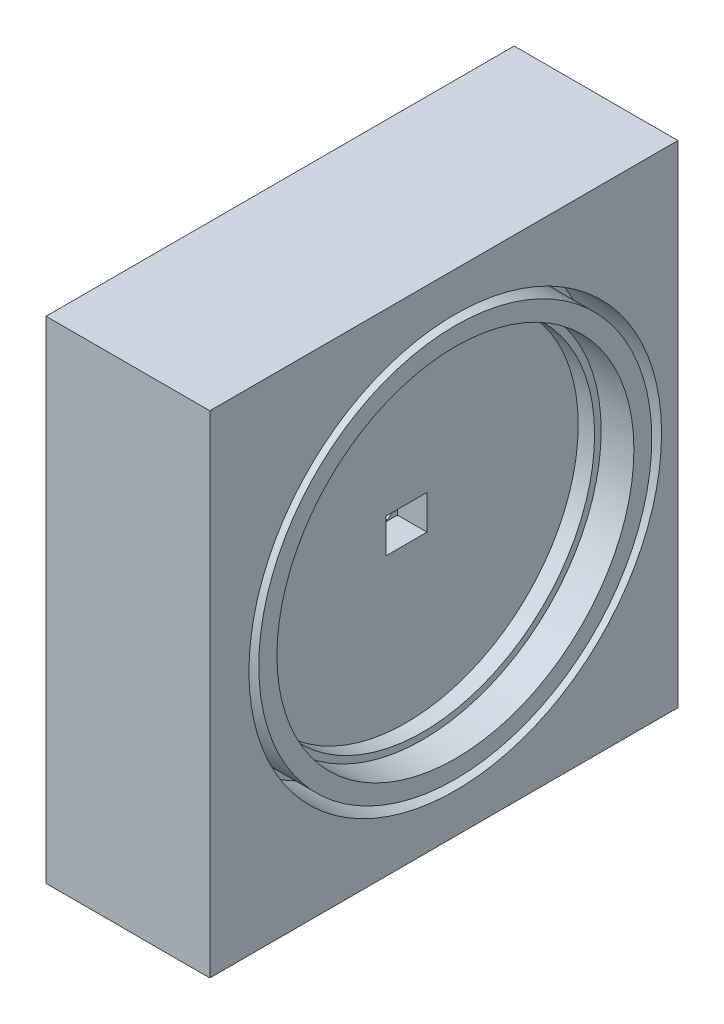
ISO-10303-21;
HEADER;
FILE_DESCRIPTION(('STEP AP214'),'2;1');
FILE_NAME('part.step','',(''),(''),'','','');
FILE_SCHEMA(('AUTOMOTIVE_DESIGN { 1 0 10303 214 1 1 1 1 }'));
ENDSEC;
DATA;
#1=APPLICATION_CONTEXT('core data for automotive mechanical design processes');
#2=APPLICATION_PROTOCOL_DEFINITION('international standard','automotive_design',2000,#1);
#3=PRODUCT_CONTEXT('',#1,'mechanical');
#4=PRODUCT('Part','Part','',(#3));
#5=PRODUCT_RELATED_PRODUCT_CATEGORY('part','',(#4));
#6=PRODUCT_DEFINITION_FORMATION('','',#4);
#7=PRODUCT_DEFINITION_CONTEXT('part definition',#1,'design');
#8=PRODUCT_DEFINITION('design','',#6,#7);
#9=PRODUCT_DEFINITION_SHAPE('','',#8);
#10=(LENGTH_UNIT() NAMED_UNIT(*) SI_UNIT(.MILLI.,.METRE.));
#11=(NAMED_UNIT(*) PLANE_ANGLE_UNIT() SI_UNIT($,.RADIAN.));
#12=(NAMED_UNIT(*) SI_UNIT($,.STERADIAN.) SOLID_ANGLE_UNIT());
#13=UNCERTAINTY_MEASURE_WITH_UNIT(LENGTH_MEASURE(1.E-05),#10,'distance_accuracy_value','');
#14=(GEOMETRIC_REPRESENTATION_CONTEXT(3) GLOBAL_UNCERTAINTY_ASSIGNED_CONTEXT((#13)) GLOBAL_UNIT_ASSIGNED_CONTEXT((#10,
#11,#12)) REPRESENTATION_CONTEXT('',''));
#15=CARTESIAN_POINT('',(0.,0.,0.));
#16=DIRECTION('',(0.,0.,1.));
#17=DIRECTION('',(1.,0.,0.));
#18=AXIS2_PLACEMENT_3D('',#15,#16,#17);
#19=CARTESIAN_POINT('',(-20.,250.,0.));
#20=DIRECTION('',(1.,0.,0.));
#21=DIRECTION('',(0.,0.,-1.));
#22=AXIS2_PLACEMENT_3D('',#19,#20,#21);
#23=PLANE('',#22);
#24=CARTESIAN_POINT('',(-20.,175.071160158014,-74.9504573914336));
#25=DIRECTION('',(1.,0.,0.));
#26=DIRECTION('',(0.,0.,-1.));
#27=AXIS2_PLACEMENT_3D('',#24,#25,#26);
#28=CIRCLE('',#27,3.50000000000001);
#29=CARTESIAN_POINT('',(-20.,175.071160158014,-78.4504573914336));
#30=VERTEX_POINT('',#29);
#31=EDGE_CURVE('E356',#30,#30,#28,.T.);
#32=ORIENTED_EDGE('',*,*,#31,.T.);
#33=EDGE_LOOP('',(#32));
#34=FACE_BOUND('',#33,.T.);
#35=DIRECTION('',(0.,0.,-1.));
#36=VECTOR('',#35,1.);
#37=CARTESIAN_POINT('',(-20.,100.,0.));
#38=LINE('',#37,#36);
#39=CARTESIAN_POINT('',(-20.,100.,0.));
#40=VERTEX_POINT('',#39);
#41=CARTESIAN_POINT('',(-20.,100.,-142.943134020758));
#42=VERTEX_POINT('',#41);
#43=EDGE_CURVE('E333',#40,#42,#38,.T.);
#44=ORIENTED_EDGE('',*,*,#43,.F.);
#45=DIRECTION('',(0.,-1.,0.));
#46=VECTOR('',#45,1.);
#47=CARTESIAN_POINT('',(-20.,250.,0.));
#48=LINE('',#47,#46);
#49=CARTESIAN_POINT('',(-20.,250.,0.));
#50=VERTEX_POINT('',#49);
#51=EDGE_CURVE('E609',#50,#40,#48,.T.);
#52=ORIENTED_EDGE('',*,*,#51,.F.);
#53=DIRECTION('',(0.,0.,1.));
#54=VECTOR('',#53,1.);
#55=CARTESIAN_POINT('',(-20.,250.,0.));
#56=LINE('',#55,#54);
#57=CARTESIAN_POINT('',(-20.,250.,-142.943134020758));
#58=VERTEX_POINT('',#57);
#59=EDGE_CURVE('E606',#58,#50,#56,.T.);
#60=ORIENTED_EDGE('',*,*,#59,.F.);
#61=DIRECTION('',(0.,-1.,0.));
#62=VECTOR('',#61,1.);
#63=CARTESIAN_POINT('',(-20.,250.,-142.943134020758));
#64=LINE('',#63,#62);
#65=EDGE_CURVE('E364',#58,#42,#64,.T.);
#66=ORIENTED_EDGE('',*,*,#65,.T.);
#67=EDGE_LOOP('',(#44,#52,#60,#66));
#68=FACE_BOUND('',#67,.T.);
#69=ADVANCED_FACE('F52',(#34,#68),#23,.F.);
#70=CARTESIAN_POINT('',(30.,250.,-150.));
#71=DIRECTION('',(-1.,0.,0.));
#72=DIRECTION('',(0.,0.,1.));
#73=AXIS2_PLACEMENT_3D('',#70,#71,#72);
#74=PLANE('',#73);
#75=CARTESIAN_POINT('',(30.,175.071160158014,-74.9504573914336));
#76=DIRECTION('',(1.,0.,0.));
#77=DIRECTION('',(0.,0.,-1.));
#78=AXIS2_PLACEMENT_3D('',#75,#76,#77);
#79=CIRCLE('',#78,63.);
#80=CARTESIAN_POINT('',(30.,175.071160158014,-137.950457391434));
#81=VERTEX_POINT('',#80);
#82=EDGE_CURVE('E341',#81,#81,#79,.T.);
#83=ORIENTED_EDGE('',*,*,#82,.F.);
#84=EDGE_LOOP('',(#83));
#85=FACE_BOUND('',#84,.T.);
#86=DIRECTION('',(0.,0.,1.));
#87=VECTOR('',#86,1.);
#88=CARTESIAN_POINT('',(30.,100.,-150.));
#89=LINE('',#88,#87);
#90=CARTESIAN_POINT('',(30.,100.,-142.943134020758));
#91=VERTEX_POINT('',#90);
#92=CARTESIAN_POINT('',(30.,100.,0.));
#93=VERTEX_POINT('',#92);
#94=EDGE_CURVE('E330',#91,#93,#89,.T.);
#95=ORIENTED_EDGE('',*,*,#94,.F.);
#96=DIRECTION('',(0.,-1.,0.));
#97=VECTOR('',#96,1.);
#98=CARTESIAN_POINT('',(30.,250.,-142.943134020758));
#99=LINE('',#98,#97);
#100=CARTESIAN_POINT('',(30.,250.,-142.943134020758));
#101=VERTEX_POINT('',#100);
#102=EDGE_CURVE('E357',#101,#91,#99,.T.);
#103=ORIENTED_EDGE('',*,*,#102,.F.);
#104=DIRECTION('',(0.,0.,-1.));
#105=VECTOR('',#104,1.);
#106=CARTESIAN_POINT('',(30.,250.,-150.));
#107=LINE('',#106,#105);
#108=CARTESIAN_POINT('',(30.,250.,0.));
#109=VERTEX_POINT('',#108);
#110=EDGE_CURVE('E602',#109,#101,#107,.T.);
#111=ORIENTED_EDGE('',*,*,#110,.F.);
#112=DIRECTION('',(0.,-1.,0.));
#113=VECTOR('',#112,1.);
#114=CARTESIAN_POINT('',(30.,250.,0.));
#115=LINE('',#114,#113);
#116=EDGE_CURVE('E613',#109,#93,#115,.T.);
#117=ORIENTED_EDGE('',*,*,#116,.T.);
#118=EDGE_LOOP('',(#95,#103,#111,#117));
#119=FACE_BOUND('',#118,.T.);
#120=ADVANCED_FACE('F482',(#85,#119),#74,.F.);
#121=CARTESIAN_POINT('',(-20.,250.,0.));
#122=DIRECTION('',(0.,0.,-1.));
#123=DIRECTION('',(-1.,0.,0.));
#124=AXIS2_PLACEMENT_3D('',#121,#122,#123);
#125=PLANE('',#124);
#126=DIRECTION('',(-1.,0.,0.));
#127=VECTOR('',#126,1.);
#128=CARTESIAN_POINT('',(80.,100.,0.));
#129=LINE('',#128,#127);
#130=EDGE_CURVE('E318',#93,#40,#129,.T.);
#131=ORIENTED_EDGE('',*,*,#130,.F.);
#132=ORIENTED_EDGE('',*,*,#116,.F.);
#133=DIRECTION('',(1.,0.,0.));
#134=VECTOR('',#133,1.);
#135=CARTESIAN_POINT('',(-20.,250.,0.));
#136=LINE('',#135,#134);
#137=EDGE_CURVE('E598',#50,#109,#136,.T.);
#138=ORIENTED_EDGE('',*,*,#137,.F.);
#139=ORIENTED_EDGE('',*,*,#51,.T.);
#140=EDGE_LOOP('',(#131,#132,#138,#139));
#141=FACE_BOUND('',#140,.T.);
#142=ADVANCED_FACE('F54',(#141),#125,.F.);
#143=CARTESIAN_POINT('',(-91.,250.,-142.943134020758));
#144=DIRECTION('',(0.,0.,1.));
#145=DIRECTION('',(0.,-1.,0.));
#146=AXIS2_PLACEMENT_3D('',#143,#144,#145);
#147=PLANE('',#146);
#148=DIRECTION('',(1.,0.,0.));
#149=VECTOR('',#148,1.);
#150=CARTESIAN_POINT('',(17.5,187.5,-142.943134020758));
#151=LINE('',#150,#149);
#152=CARTESIAN_POINT('',(-7.50000000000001,187.5,-142.943134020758));
#153=VERTEX_POINT('',#152);
#154=CARTESIAN_POINT('',(17.5,187.5,-142.943134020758));
#155=VERTEX_POINT('',#154);
#156=EDGE_CURVE('E250',#153,#155,#151,.T.);
#157=ORIENTED_EDGE('',*,*,#156,.F.);
#158=DIRECTION('',(0.,1.,0.));
#159=VECTOR('',#158,1.);
#160=CARTESIAN_POINT('',(-7.50000000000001,162.5,-142.943134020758));
#161=LINE('',#160,#159);
#162=CARTESIAN_POINT('',(-7.50000000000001,162.5,-142.943134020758));
#163=VERTEX_POINT('',#162);
#164=EDGE_CURVE('E68',#163,#153,#161,.T.);
#165=ORIENTED_EDGE('',*,*,#164,.F.);
#166=DIRECTION('',(-1.,0.,0.));
#167=VECTOR('',#166,1.);
#168=CARTESIAN_POINT('',(17.5,162.5,-142.943134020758));
#169=LINE('',#168,#167);
#170=CARTESIAN_POINT('',(17.5,162.5,-142.943134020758));
#171=VERTEX_POINT('',#170);
#172=EDGE_CURVE('E237',#171,#163,#169,.T.);
#173=ORIENTED_EDGE('',*,*,#172,.F.);
#174=DIRECTION('',(0.,-1.,0.));
#175=VECTOR('',#174,1.);
#176=CARTESIAN_POINT('',(17.5,162.5,-142.943134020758));
#177=LINE('',#176,#175);
#178=EDGE_CURVE('E241',#155,#171,#177,.T.);
#179=ORIENTED_EDGE('',*,*,#178,.F.);
#180=EDGE_LOOP('',(#157,#165,#173,#179));
#181=FACE_BOUND('',#180,.T.);
#182=DIRECTION('',(1.,0.,0.));
#183=VECTOR('',#182,1.);
#184=CARTESIAN_POINT('',(-91.,100.,-142.943134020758));
#185=LINE('',#184,#183);
#186=EDGE_CURVE('E617',#42,#91,#185,.T.);
#187=ORIENTED_EDGE('',*,*,#186,.F.);
#188=ORIENTED_EDGE('',*,*,#65,.F.);
#189=DIRECTION('',(1.,0.,0.));
#190=VECTOR('',#189,1.);
#191=CARTESIAN_POINT('',(-91.,250.,-142.943134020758));
#192=LINE('',#191,#190);
#193=EDGE_CURVE('E361',#58,#101,#192,.T.);
#194=ORIENTED_EDGE('',*,*,#193,.T.);
#195=ORIENTED_EDGE('',*,*,#102,.T.);
#196=EDGE_LOOP('',(#187,#188,#194,#195));
#197=FACE_BOUND('',#196,.T.);
#198=ADVANCED_FACE('F489',(#181,#197),#147,.F.);
#199=CARTESIAN_POINT('',(30.,175.,-75.));
#200=DIRECTION('',(1.,0.,0.));
#201=DIRECTION('',(0.,0.,-1.));
#202=AXIS2_PLACEMENT_3D('',#199,#200,#201);
#203=CIRCLE('',#202,54.5);
#204=CARTESIAN_POINT('',(30.,175.,-129.5));
#205=VERTEX_POINT('',#204);
#206=EDGE_CURVE('E368',#205,#205,#203,.T.);
#207=ORIENTED_EDGE('',*,*,#206,.F.);
#208=EDGE_LOOP('',(#207));
#209=FACE_BOUND('',#208,.T.);
#210=CARTESIAN_POINT('',(30.,175.071160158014,-74.9504573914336));
#211=DIRECTION('',(1.,0.,0.));
#212=DIRECTION('',(0.,0.,-1.));
#213=AXIS2_PLACEMENT_3D('',#210,#211,#212);
#214=CIRCLE('',#213,60.);
#215=CARTESIAN_POINT('',(30.,175.071160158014,-134.950457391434));
#216=VERTEX_POINT('',#215);
#217=EDGE_CURVE('E336',#216,#216,#214,.T.);
#218=ORIENTED_EDGE('',*,*,#217,.T.);
#219=EDGE_LOOP('',(#218));
#220=FACE_BOUND('',#219,.T.);
#221=ADVANCED_FACE('F473',(#209,#220),#74,.F.);
#222=CARTESIAN_POINT('',(15.,175.,-75.));
#223=DIRECTION('',(1.,0.,0.));
#224=DIRECTION('',(0.,0.,-1.));
#225=AXIS2_PLACEMENT_3D('',#222,#223,#224);
#226=CYLINDRICAL_SURFACE('',#225,52.5);
#227=CARTESIAN_POINT('',(15.,175.,-75.));
#228=DIRECTION('',(1.,0.,0.));
#229=DIRECTION('',(0.,0.,-1.));
#230=AXIS2_PLACEMENT_3D('',#227,#228,#229);
#231=CIRCLE('',#230,52.5);
#232=CARTESIAN_POINT('',(15.,175.,-127.5));
#233=VERTEX_POINT('',#232);
#234=EDGE_CURVE('E583',#233,#233,#231,.T.);
#235=ORIENTED_EDGE('',*,*,#234,.F.);
#236=EDGE_LOOP('',(#235));
#237=FACE_BOUND('',#236,.T.);
#238=CARTESIAN_POINT('',(20.,175.,-75.));
#239=DIRECTION('',(1.,0.,0.));
#240=DIRECTION('',(0.,0.,-1.));
#241=AXIS2_PLACEMENT_3D('',#238,#239,#240);
#242=CIRCLE('',#241,52.5);
#243=CARTESIAN_POINT('',(20.,175.,-127.5));
#244=VERTEX_POINT('',#243);
#245=EDGE_CURVE('E373',#244,#244,#242,.F.);
#246=ORIENTED_EDGE('',*,*,#245,.F.);
#247=EDGE_LOOP('',(#246));
#248=FACE_BOUND('',#247,.T.);
#249=ADVANCED_FACE('F469',(#237,#248),#226,.F.);
#250=CARTESIAN_POINT('',(15.,175.,-75.));
#251=DIRECTION('',(1.,0.,0.));
#252=DIRECTION('',(0.,0.,-1.));
#253=AXIS2_PLACEMENT_3D('',#250,#251,#252);
#254=PLANE('',#253);
#255=ORIENTED_EDGE('',*,*,#234,.T.);
#256=EDGE_LOOP('',(#255));
#257=FACE_BOUND('',#256,.T.);
#258=DIRECTION('',(0.,1.,0.));
#259=VECTOR('',#258,1.);
#260=CARTESIAN_POINT('',(15.,0.,-68.8182979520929));
#261=LINE('',#260,#259);
#262=CARTESIAN_POINT('',(15.,169.75,-68.8182979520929));
#263=VERTEX_POINT('',#262);
#264=CARTESIAN_POINT('',(15.,180.25,-68.8182979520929));
#265=VERTEX_POINT('',#264);
#266=EDGE_CURVE('E419',#263,#265,#261,.T.);
#267=ORIENTED_EDGE('',*,*,#266,.T.);
#268=DIRECTION('',(0.,0.,-1.));
#269=VECTOR('',#268,1.);
#270=CARTESIAN_POINT('',(15.,180.25,0.));
#271=LINE('',#270,#269);
#272=CARTESIAN_POINT('',(15.,180.25,-81.3182979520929));
#273=VERTEX_POINT('',#272);
#274=EDGE_CURVE('E412',#265,#273,#271,.T.);
#275=ORIENTED_EDGE('',*,*,#274,.T.);
#276=DIRECTION('',(0.,-1.,0.));
#277=VECTOR('',#276,1.);
#278=CARTESIAN_POINT('',(15.,0.,-81.3182979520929));
#279=LINE('',#278,#277);
#280=CARTESIAN_POINT('',(15.,169.75,-81.3182979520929));
#281=VERTEX_POINT('',#280);
#282=EDGE_CURVE('E382',#273,#281,#279,.T.);
#283=ORIENTED_EDGE('',*,*,#282,.T.);
#284=DIRECTION('',(0.,0.,-1.));
#285=VECTOR('',#284,1.);
#286=CARTESIAN_POINT('',(15.,169.75,0.));
#287=LINE('',#286,#285);
#288=EDGE_CURVE('E423',#263,#281,#287,.T.);
#289=ORIENTED_EDGE('',*,*,#288,.F.);
#290=EDGE_LOOP('',(#267,#275,#283,#289));
#291=FACE_BOUND('',#290,.T.);
#292=ADVANCED_FACE('F465',(#257,#291),#254,.T.);
#293=CARTESIAN_POINT('',(6.,180.25,0.));
#294=DIRECTION('',(0.,-1.,0.));
#295=DIRECTION('',(0.,0.,-1.));
#296=AXIS2_PLACEMENT_3D('',#293,#294,#295);
#297=PLANE('',#296);
#298=ORIENTED_EDGE('',*,*,#274,.F.);
#299=DIRECTION('',(1.,0.,0.));
#300=VECTOR('',#299,1.);
#301=CARTESIAN_POINT('',(6.,180.25,-68.8182979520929));
#302=LINE('',#301,#300);
#303=CARTESIAN_POINT('',(6.,180.25,-68.8182979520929));
#304=VERTEX_POINT('',#303);
#305=EDGE_CURVE('E411',#304,#265,#302,.T.);
#306=ORIENTED_EDGE('',*,*,#305,.F.);
#307=DIRECTION('',(0.,0.,-1.));
#308=VECTOR('',#307,1.);
#309=CARTESIAN_POINT('',(6.,180.25,0.));
#310=LINE('',#309,#308);
#311=CARTESIAN_POINT('',(6.,180.25,-81.3182979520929));
#312=VERTEX_POINT('',#311);
#313=EDGE_CURVE('E377',#304,#312,#310,.T.);
#314=ORIENTED_EDGE('',*,*,#313,.T.);
#315=DIRECTION('',(1.,0.,0.));
#316=VECTOR('',#315,1.);
#317=CARTESIAN_POINT('',(6.,180.25,-81.3182979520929));
#318=LINE('',#317,#316);
#319=EDGE_CURVE('E430',#312,#273,#318,.T.);
#320=ORIENTED_EDGE('',*,*,#319,.T.);
#321=EDGE_LOOP('',(#298,#306,#314,#320));
#322=FACE_BOUND('',#321,.T.);
#323=ADVANCED_FACE('F468',(#322),#297,.T.);
#324=CARTESIAN_POINT('',(6.,0.,-81.3182979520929));
#325=DIRECTION('',(0.,0.,1.));
#326=DIRECTION('',(1.,0.,0.));
#327=AXIS2_PLACEMENT_3D('',#324,#325,#326);
#328=PLANE('',#327);
#329=ORIENTED_EDGE('',*,*,#282,.F.);
#330=ORIENTED_EDGE('',*,*,#319,.F.);
#331=DIRECTION('',(0.,-1.,0.));
#332=VECTOR('',#331,1.);
#333=CARTESIAN_POINT('',(6.,0.,-81.3182979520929));
#334=LINE('',#333,#332);
#335=CARTESIAN_POINT('',(6.,169.75,-81.3182979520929));
#336=VERTEX_POINT('',#335);
#337=EDGE_CURVE('E389',#312,#336,#334,.T.);
#338=ORIENTED_EDGE('',*,*,#337,.T.);
#339=DIRECTION('',(1.,0.,0.));
#340=VECTOR('',#339,1.);
#341=CARTESIAN_POINT('',(6.,169.75,-81.3182979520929));
#342=LINE('',#341,#340);
#343=EDGE_CURVE('E435',#336,#281,#342,.T.);
#344=ORIENTED_EDGE('',*,*,#343,.T.);
#345=EDGE_LOOP('',(#329,#330,#338,#344));
#346=FACE_BOUND('',#345,.T.);
#347=ADVANCED_FACE('F542',(#346),#328,.T.);
#348=CARTESIAN_POINT('',(6.,169.75,0.));
#349=DIRECTION('',(0.,-1.,0.));
#350=DIRECTION('',(0.,0.,-1.));
#351=AXIS2_PLACEMENT_3D('',#348,#349,#350);
#352=PLANE('',#351);
#353=ORIENTED_EDGE('',*,*,#288,.T.);
#354=ORIENTED_EDGE('',*,*,#343,.F.);
#355=DIRECTION('',(0.,0.,-1.));
#356=VECTOR('',#355,1.);
#357=CARTESIAN_POINT('',(6.,169.75,0.));
#358=LINE('',#357,#356);
#359=CARTESIAN_POINT('',(6.,169.75,-68.8182979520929));
#360=VERTEX_POINT('',#359);
#361=EDGE_CURVE('E385',#360,#336,#358,.T.);
#362=ORIENTED_EDGE('',*,*,#361,.F.);
#363=DIRECTION('',(1.,0.,0.));
#364=VECTOR('',#363,1.);
#365=CARTESIAN_POINT('',(6.,169.75,-68.8182979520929));
#366=LINE('',#365,#364);
#367=EDGE_CURVE('E438',#360,#263,#366,.T.);
#368=ORIENTED_EDGE('',*,*,#367,.T.);
#369=EDGE_LOOP('',(#353,#354,#362,#368));
#370=FACE_BOUND('',#369,.T.);
#371=ADVANCED_FACE('F545',(#370),#352,.F.);
#372=CARTESIAN_POINT('',(6.,0.,-68.8182979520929));
#373=DIRECTION('',(0.,0.,-1.));
#374=DIRECTION('',(-1.,0.,0.));
#375=AXIS2_PLACEMENT_3D('',#372,#373,#374);
#376=PLANE('',#375);
#377=ORIENTED_EDGE('',*,*,#266,.F.);
#378=ORIENTED_EDGE('',*,*,#367,.F.);
#379=DIRECTION('',(0.,1.,0.));
#380=VECTOR('',#379,1.);
#381=CARTESIAN_POINT('',(6.,0.,-68.8182979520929));
#382=LINE('',#381,#380);
#383=EDGE_CURVE('E381',#360,#304,#382,.T.);
#384=ORIENTED_EDGE('',*,*,#383,.T.);
#385=ORIENTED_EDGE('',*,*,#305,.T.);
#386=EDGE_LOOP('',(#377,#378,#384,#385));
#387=FACE_BOUND('',#386,.T.);
#388=ADVANCED_FACE('F540',(#387),#376,.T.);
#389=CARTESIAN_POINT('',(6.,0.,0.));
#390=DIRECTION('',(1.,0.,0.));
#391=DIRECTION('',(0.,0.,-1.));
#392=AXIS2_PLACEMENT_3D('',#389,#390,#391);
#393=PLANE('',#392);
#394=ORIENTED_EDGE('',*,*,#313,.F.);
#395=ORIENTED_EDGE('',*,*,#383,.F.);
#396=ORIENTED_EDGE('',*,*,#361,.T.);
#397=ORIENTED_EDGE('',*,*,#337,.F.);
#398=EDGE_LOOP('',(#394,#395,#396,#397));
#399=FACE_BOUND('',#398,.T.);
#400=DIRECTION('',(0.,0.,1.));
#401=VECTOR('',#400,1.);
#402=CARTESIAN_POINT('',(6.,170.,0.));
#403=LINE('',#402,#401);
#404=CARTESIAN_POINT('',(6.,170.,-78.25));
#405=VERTEX_POINT('',#404);
#406=CARTESIAN_POINT('',(6.,170.,-71.75));
#407=VERTEX_POINT('',#406);
#408=EDGE_CURVE('E392',#405,#407,#403,.T.);
#409=ORIENTED_EDGE('',*,*,#408,.T.);
#410=CARTESIAN_POINT('',(6.,170.,-71.75));
#411=CARTESIAN_POINT('',(6.,175.,-66.0579946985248));
#412=CARTESIAN_POINT('',(6.,180.,-71.75));
#413=B_SPLINE_CURVE_WITH_KNOTS('',2,(#410,#411,#412),.UNSPECIFIED.,.F.,.F.,(3,3),(0.,1.),.UNSPECIFIED.);
#414=CARTESIAN_POINT('',(6.,180.,-71.75));
#415=VERTEX_POINT('',#414);
#416=EDGE_CURVE('E395',#407,#415,#413,.T.);
#417=ORIENTED_EDGE('',*,*,#416,.T.);
#418=DIRECTION('',(0.,0.,-1.));
#419=VECTOR('',#418,1.);
#420=CARTESIAN_POINT('',(6.,180.,0.));
#421=LINE('',#420,#419);
#422=CARTESIAN_POINT('',(6.,180.,-78.25));
#423=VERTEX_POINT('',#422);
#424=EDGE_CURVE('E400',#415,#423,#421,.T.);
#425=ORIENTED_EDGE('',*,*,#424,.T.);
#426=CARTESIAN_POINT('',(6.,180.,-78.25));
#427=CARTESIAN_POINT('',(6.,175.,-84.285140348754));
#428=CARTESIAN_POINT('',(6.,170.,-78.25));
#429=B_SPLINE_CURVE_WITH_KNOTS('',2,(#426,#427,#428),.UNSPECIFIED.,.F.,.F.,(3,3),(0.,1.),.UNSPECIFIED.);
#430=EDGE_CURVE('E406',#423,#405,#429,.T.);
#431=ORIENTED_EDGE('',*,*,#430,.T.);
#432=EDGE_LOOP('',(#409,#417,#425,#431));
#433=FACE_BOUND('',#432,.T.);
#434=ADVANCED_FACE('F536',(#399,#433),#393,.T.);
#435=CARTESIAN_POINT('',(-5.,175.,-68.9039973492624));
#436=DIRECTION('',(-1.,0.,0.));
#437=DIRECTION('',(0.,0.,1.));
#438=AXIS2_PLACEMENT_3D('',#435,#436,#437);
#439=PLANE('',#438);
#440=CARTESIAN_POINT('',(-5.,175.071160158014,-74.9504573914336));
#441=DIRECTION('',(1.,0.,0.));
#442=DIRECTION('',(0.,0.,-1.));
#443=AXIS2_PLACEMENT_3D('',#440,#441,#442);
#444=CIRCLE('',#443,3.50000000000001);
#445=CARTESIAN_POINT('',(-5.,175.071160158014,-78.4504573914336));
#446=VERTEX_POINT('',#445);
#447=EDGE_CURVE('E349',#446,#446,#444,.T.);
#448=ORIENTED_EDGE('',*,*,#447,.F.);
#449=EDGE_LOOP('',(#448));
#450=FACE_BOUND('',#449,.T.);
#451=CARTESIAN_POINT('',(-5.,180.,-71.75));
#452=CARTESIAN_POINT('',(-5.,175.,-66.0579946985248));
#453=CARTESIAN_POINT('',(-5.,170.,-71.75));
#454=B_SPLINE_CURVE_WITH_KNOTS('',2,(#451,#452,#453),.UNSPECIFIED.,.F.,.F.,(3,3),(0.,1.),.UNSPECIFIED.);
#455=CARTESIAN_POINT('',(-5.,180.,-71.75));
#456=VERTEX_POINT('',#455);
#457=CARTESIAN_POINT('',(-5.,170.,-71.75));
#458=VERTEX_POINT('',#457);
#459=EDGE_CURVE('E434',#456,#458,#454,.T.);
#460=ORIENTED_EDGE('',*,*,#459,.T.);
#461=DIRECTION('',(0.,0.,-1.));
#462=VECTOR('',#461,1.);
#463=CARTESIAN_POINT('',(-5.,170.,-71.75));
#464=LINE('',#463,#462);
#465=CARTESIAN_POINT('',(-5.,170.,-78.25));
#466=VERTEX_POINT('',#465);
#467=EDGE_CURVE('E450',#458,#466,#464,.T.);
#468=ORIENTED_EDGE('',*,*,#467,.T.);
#469=CARTESIAN_POINT('',(-5.,170.,-78.25));
#470=CARTESIAN_POINT('',(-5.,175.,-84.285140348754));
#471=CARTESIAN_POINT('',(-5.,180.,-78.25));
#472=B_SPLINE_CURVE_WITH_KNOTS('',2,(#469,#470,#471),.UNSPECIFIED.,.F.,.F.,(3,3),(0.,1.),.UNSPECIFIED.);
#473=CARTESIAN_POINT('',(-5.,180.,-78.25));
#474=VERTEX_POINT('',#473);
#475=EDGE_CURVE('E564',#466,#474,#472,.T.);
#476=ORIENTED_EDGE('',*,*,#475,.T.);
#477=DIRECTION('',(0.,0.,1.));
#478=VECTOR('',#477,1.);
#479=CARTESIAN_POINT('',(-5.,180.,-71.75));
#480=LINE('',#479,#478);
#481=EDGE_CURVE('E571',#474,#456,#480,.T.);
#482=ORIENTED_EDGE('',*,*,#481,.T.);
#483=EDGE_LOOP('',(#460,#468,#476,#482));
#484=FACE_BOUND('',#483,.T.);
#485=ADVANCED_FACE('F539',(#450,#484),#439,.F.);
#486=CARTESIAN_POINT('',(-5.,170.,-71.75));
#487=DIRECTION('',(0.,-1.,0.));
#488=DIRECTION('',(0.,0.,-1.));
#489=AXIS2_PLACEMENT_3D('',#486,#487,#488);
#490=PLANE('',#489);
#491=ORIENTED_EDGE('',*,*,#408,.F.);
#492=DIRECTION('',(1.,0.,0.));
#493=VECTOR('',#492,1.);
#494=CARTESIAN_POINT('',(-5.,170.,-78.25));
#495=LINE('',#494,#493);
#496=EDGE_CURVE('E588',#466,#405,#495,.T.);
#497=ORIENTED_EDGE('',*,*,#496,.F.);
#498=ORIENTED_EDGE('',*,*,#467,.F.);
#499=DIRECTION('',(1.,0.,0.));
#500=VECTOR('',#499,1.);
#501=CARTESIAN_POINT('',(-5.,170.,-71.75));
#502=LINE('',#501,#500);
#503=EDGE_CURVE('E578',#458,#407,#502,.T.);
#504=ORIENTED_EDGE('',*,*,#503,.T.);
#505=EDGE_LOOP('',(#491,#497,#498,#504));
#506=FACE_BOUND('',#505,.T.);
#507=ADVANCED_FACE('F463',(#506),#490,.F.);
#508=DIRECTION('',(1.,0.,0.));
#509=VECTOR('',#508,1.);
#510=SURFACE_OF_LINEAR_EXTRUSION('',#472,#509);
#511=ORIENTED_EDGE('',*,*,#430,.F.);
#512=DIRECTION('',(1.,0.,0.));
#513=VECTOR('',#512,1.);
#514=CARTESIAN_POINT('',(-5.,180.,-78.25));
#515=LINE('',#514,#513);
#516=EDGE_CURVE('E584',#474,#423,#515,.T.);
#517=ORIENTED_EDGE('',*,*,#516,.F.);
#518=ORIENTED_EDGE('',*,*,#475,.F.);
#519=ORIENTED_EDGE('',*,*,#496,.T.);
#520=EDGE_LOOP('',(#511,#517,#518,#519));
#521=FACE_BOUND('',#520,.T.);
#522=ADVANCED_FACE('F560',(#521),#510,.F.);
#523=CARTESIAN_POINT('',(-5.,180.,-71.75));
#524=DIRECTION('',(0.,1.,0.));
#525=DIRECTION('',(0.,0.,1.));
#526=AXIS2_PLACEMENT_3D('',#523,#524,#525);
#527=PLANE('',#526);
#528=ORIENTED_EDGE('',*,*,#424,.F.);
#529=DIRECTION('',(1.,0.,0.));
#530=VECTOR('',#529,1.);
#531=CARTESIAN_POINT('',(-5.,180.,-71.75));
#532=LINE('',#531,#530);
#533=EDGE_CURVE('E579',#456,#415,#532,.T.);
#534=ORIENTED_EDGE('',*,*,#533,.F.);
#535=ORIENTED_EDGE('',*,*,#481,.F.);
#536=ORIENTED_EDGE('',*,*,#516,.T.);
#537=EDGE_LOOP('',(#528,#534,#535,#536));
#538=FACE_BOUND('',#537,.T.);
#539=ADVANCED_FACE('F461',(#538),#527,.F.);
#540=DIRECTION('',(1.,0.,0.));
#541=VECTOR('',#540,1.);
#542=SURFACE_OF_LINEAR_EXTRUSION('',#454,#541);
#543=ORIENTED_EDGE('',*,*,#416,.F.);
#544=ORIENTED_EDGE('',*,*,#503,.F.);
#545=ORIENTED_EDGE('',*,*,#459,.F.);
#546=ORIENTED_EDGE('',*,*,#533,.T.);
#547=EDGE_LOOP('',(#543,#544,#545,#546));
#548=FACE_BOUND('',#547,.T.);
#549=ADVANCED_FACE('F456',(#548),#542,.F.);
#550=CARTESIAN_POINT('',(20.,175.,-75.));
#551=DIRECTION('',(1.,0.,0.));
#552=DIRECTION('',(0.,0.,-1.));
#553=AXIS2_PLACEMENT_3D('',#550,#551,#552);
#554=PLANE('',#553);
#555=CARTESIAN_POINT('',(20.,175.,-75.));
#556=DIRECTION('',(1.,0.,0.));
#557=DIRECTION('',(0.,0.,-1.));
#558=AXIS2_PLACEMENT_3D('',#555,#556,#557);
#559=CIRCLE('',#558,54.5);
#560=CARTESIAN_POINT('',(20.,175.,-129.5));
#561=VERTEX_POINT('',#560);
#562=EDGE_CURVE('E369',#561,#561,#559,.T.);
#563=ORIENTED_EDGE('',*,*,#562,.T.);
#564=EDGE_LOOP('',(#563));
#565=FACE_BOUND('',#564,.T.);
#566=ORIENTED_EDGE('',*,*,#245,.T.);
#567=EDGE_LOOP('',(#566));
#568=FACE_BOUND('',#567,.T.);
#569=ADVANCED_FACE('F460',(#565,#568),#554,.T.);
#570=CARTESIAN_POINT('',(20.,175.,-75.));
#571=DIRECTION('',(1.,0.,0.));
#572=DIRECTION('',(0.,0.,-1.));
#573=AXIS2_PLACEMENT_3D('',#570,#571,#572);
#574=CYLINDRICAL_SURFACE('',#573,54.5);
#575=ORIENTED_EDGE('',*,*,#562,.F.);
#576=EDGE_LOOP('',(#575));
#577=FACE_BOUND('',#576,.T.);
#578=ORIENTED_EDGE('',*,*,#206,.T.);
#579=EDGE_LOOP('',(#578));
#580=FACE_BOUND('',#579,.T.);
#581=ADVANCED_FACE('F479',(#577,#580),#574,.F.);
#582=CARTESIAN_POINT('',(0.,250.,0.));
#583=DIRECTION('',(0.,-1.,0.));
#584=DIRECTION('',(0.,0.,-1.));
#585=AXIS2_PLACEMENT_3D('',#582,#583,#584);
#586=PLANE('',#585);
#587=ORIENTED_EDGE('',*,*,#110,.T.);
#588=ORIENTED_EDGE('',*,*,#193,.F.);
#589=ORIENTED_EDGE('',*,*,#59,.T.);
#590=ORIENTED_EDGE('',*,*,#137,.T.);
#591=EDGE_LOOP('',(#587,#588,#589,#590));
#592=FACE_BOUND('',#591,.T.);
#593=ADVANCED_FACE('F475',(#592),#586,.F.);
#594=CARTESIAN_POINT('',(-25.,175.071160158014,-74.9504573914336));
#595=DIRECTION('',(1.,0.,0.));
#596=DIRECTION('',(0.,0.,-1.));
#597=AXIS2_PLACEMENT_3D('',#594,#595,#596);
#598=CYLINDRICAL_SURFACE('',#597,3.50000000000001);
#599=ORIENTED_EDGE('',*,*,#447,.T.);
#600=EDGE_LOOP('',(#599));
#601=FACE_BOUND('',#600,.T.);
#602=ORIENTED_EDGE('',*,*,#31,.F.);
#603=EDGE_LOOP('',(#602));
#604=FACE_BOUND('',#603,.T.);
#605=ADVANCED_FACE('F478',(#601,#604),#598,.F.);
#606=CARTESIAN_POINT('',(10.,175.071160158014,-74.9504573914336));
#607=DIRECTION('',(1.,0.,0.));
#608=DIRECTION('',(0.,0.,-1.));
#609=AXIS2_PLACEMENT_3D('',#606,#607,#608);
#610=CYLINDRICAL_SURFACE('',#609,63.);
#611=CARTESIAN_POINT('',(17.5,175.071160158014,-74.9504573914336));
#612=DIRECTION('',(1.,0.,0.));
#613=DIRECTION('',(0.,0.,-1.));
#614=AXIS2_PLACEMENT_3D('',#611,#612,#613);
#615=CIRCLE('',#614,63.);
#616=CARTESIAN_POINT('',(17.5,187.5,-136.712289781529));
#617=VERTEX_POINT('',#616);
#618=CARTESIAN_POINT('',(17.5,162.5,-136.683478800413));
#619=VERTEX_POINT('',#618);
#620=EDGE_CURVE('E272',#617,#619,#615,.F.);
#621=ORIENTED_EDGE('',*,*,#620,.T.);
#622=DIRECTION('',(1.,0.,0.));
#623=VECTOR('',#622,1.);
#624=CARTESIAN_POINT('',(10.,162.5,-136.683478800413));
#625=LINE('',#624,#623);
#626=CARTESIAN_POINT('',(10.,162.5,-136.683478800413));
#627=VERTEX_POINT('',#626);
#628=EDGE_CURVE('E279',#619,#627,#625,.F.);
#629=ORIENTED_EDGE('',*,*,#628,.T.);
#630=CARTESIAN_POINT('',(10.,175.071160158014,-74.9504573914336));
#631=DIRECTION('',(1.,0.,0.));
#632=DIRECTION('',(0.,0.,-1.));
#633=AXIS2_PLACEMENT_3D('',#630,#631,#632);
#634=CIRCLE('',#633,63.);
#635=CARTESIAN_POINT('',(10.,187.5,-136.712289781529));
#636=VERTEX_POINT('',#635);
#637=EDGE_CURVE('E345',#636,#627,#634,.T.);
#638=ORIENTED_EDGE('',*,*,#637,.F.);
#639=DIRECTION('',(1.,0.,0.));
#640=VECTOR('',#639,1.);
#641=CARTESIAN_POINT('',(10.,187.5,-136.712289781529));
#642=LINE('',#641,#640);
#643=EDGE_CURVE('E268',#636,#617,#642,.T.);
#644=ORIENTED_EDGE('',*,*,#643,.T.);
#645=EDGE_LOOP('',(#621,#629,#638,#644));
#646=FACE_BOUND('',#645,.T.);
#647=ORIENTED_EDGE('',*,*,#82,.T.);
#648=EDGE_LOOP('',(#647));
#649=FACE_BOUND('',#648,.T.);
#650=ADVANCED_FACE('F518',(#646,#649),#610,.F.);
#651=CARTESIAN_POINT('',(10.,175.071160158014,-74.9504573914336));
#652=DIRECTION('',(1.,0.,0.));
#653=DIRECTION('',(0.,0.,-1.));
#654=AXIS2_PLACEMENT_3D('',#651,#652,#653);
#655=PLANE('',#654);
#656=DIRECTION('',(0.,0.,-1.));
#657=VECTOR('',#656,1.);
#658=CARTESIAN_POINT('',(10.,162.5,-74.9504573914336));
#659=LINE('',#658,#657);
#660=CARTESIAN_POINT('',(10.,162.5,-133.618727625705));
#661=VERTEX_POINT('',#660);
#662=EDGE_CURVE('E276',#661,#627,#659,.T.);
#663=ORIENTED_EDGE('',*,*,#662,.F.);
#664=CARTESIAN_POINT('',(10.,175.071160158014,-74.9504573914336));
#665=DIRECTION('',(1.,0.,0.));
#666=DIRECTION('',(0.,0.,-1.));
#667=AXIS2_PLACEMENT_3D('',#664,#665,#666);
#668=CIRCLE('',#667,60.);
#669=CARTESIAN_POINT('',(10.,187.5,-133.649042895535));
#670=VERTEX_POINT('',#669);
#671=EDGE_CURVE('E337',#670,#661,#668,.T.);
#672=ORIENTED_EDGE('',*,*,#671,.F.);
#673=DIRECTION('',(0.,0.,1.));
#674=VECTOR('',#673,1.);
#675=CARTESIAN_POINT('',(10.,187.5,-74.9504573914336));
#676=LINE('',#675,#674);
#677=EDGE_CURVE('E76',#636,#670,#676,.T.);
#678=ORIENTED_EDGE('',*,*,#677,.F.);
#679=ORIENTED_EDGE('',*,*,#637,.T.);
#680=EDGE_LOOP('',(#663,#672,#678,#679));
#681=FACE_BOUND('',#680,.T.);
#682=ADVANCED_FACE('F507',(#681),#655,.T.);
#683=CARTESIAN_POINT('',(10.,175.071160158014,-74.9504573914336));
#684=DIRECTION('',(1.,0.,0.));
#685=DIRECTION('',(0.,0.,-1.));
#686=AXIS2_PLACEMENT_3D('',#683,#684,#685);
#687=CYLINDRICAL_SURFACE('',#686,60.);
#688=DIRECTION('',(1.,0.,0.));
#689=VECTOR('',#688,1.);
#690=CARTESIAN_POINT('',(10.,162.5,-133.618727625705));
#691=LINE('',#690,#689);
#692=CARTESIAN_POINT('',(17.5,162.5,-133.618727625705));
#693=VERTEX_POINT('',#692);
#694=EDGE_CURVE('E12',#693,#661,#691,.F.);
#695=ORIENTED_EDGE('',*,*,#694,.F.);
#696=CARTESIAN_POINT('',(17.5,175.071160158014,-74.9504573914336));
#697=DIRECTION('',(1.,0.,0.));
#698=DIRECTION('',(0.,0.,-1.));
#699=AXIS2_PLACEMENT_3D('',#696,#697,#698);
#700=CIRCLE('',#699,60.);
#701=CARTESIAN_POINT('',(17.5,187.5,-133.649042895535));
#702=VERTEX_POINT('',#701);
#703=EDGE_CURVE('E61',#702,#693,#700,.F.);
#704=ORIENTED_EDGE('',*,*,#703,.F.);
#705=DIRECTION('',(1.,0.,0.));
#706=VECTOR('',#705,1.);
#707=CARTESIAN_POINT('',(10.,187.5,-133.649042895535));
#708=LINE('',#707,#706);
#709=EDGE_CURVE('E626',#670,#702,#708,.T.);
#710=ORIENTED_EDGE('',*,*,#709,.F.);
#711=ORIENTED_EDGE('',*,*,#671,.T.);
#712=EDGE_LOOP('',(#695,#704,#710,#711));
#713=FACE_BOUND('',#712,.T.);
#714=ORIENTED_EDGE('',*,*,#217,.F.);
#715=EDGE_LOOP('',(#714));
#716=FACE_BOUND('',#715,.T.);
#717=ADVANCED_FACE('F504',(#713,#716),#687,.T.);
#718=CARTESIAN_POINT('',(80.,100.,-142.943134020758));
#719=DIRECTION('',(0.,-1.,0.));
#720=DIRECTION('',(0.,0.,-1.));
#721=AXIS2_PLACEMENT_3D('',#718,#719,#720);
#722=PLANE('',#721);
#723=DIRECTION('',(0.,0.,1.));
#724=VECTOR('',#723,1.);
#725=CARTESIAN_POINT('',(17.5,100.,-83.971567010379));
#726=LINE('',#725,#724);
#727=CARTESIAN_POINT('',(17.5,100.,-83.971567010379));
#728=VERTEX_POINT('',#727);
#729=CARTESIAN_POINT('',(17.5,100.,-58.971567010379));
#730=VERTEX_POINT('',#729);
#731=EDGE_CURVE('E283',#728,#730,#726,.T.);
#732=ORIENTED_EDGE('',*,*,#731,.F.);
#733=DIRECTION('',(1.,0.,0.));
#734=VECTOR('',#733,1.);
#735=CARTESIAN_POINT('',(-7.49999999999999,100.,-83.971567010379));
#736=LINE('',#735,#734);
#737=CARTESIAN_POINT('',(-7.49999999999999,100.,-83.971567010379));
#738=VERTEX_POINT('',#737);
#739=EDGE_CURVE('E289',#738,#728,#736,.T.);
#740=ORIENTED_EDGE('',*,*,#739,.F.);
#741=DIRECTION('',(0.,0.,-1.));
#742=VECTOR('',#741,1.);
#743=CARTESIAN_POINT('',(-7.49999999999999,100.,-83.971567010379));
#744=LINE('',#743,#742);
#745=CARTESIAN_POINT('',(-7.49999999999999,100.,-58.971567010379));
#746=VERTEX_POINT('',#745);
#747=EDGE_CURVE('E308',#746,#738,#744,.T.);
#748=ORIENTED_EDGE('',*,*,#747,.F.);
#749=DIRECTION('',(-1.,0.,0.));
#750=VECTOR('',#749,1.);
#751=CARTESIAN_POINT('',(-7.49999999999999,100.,-58.971567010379));
#752=LINE('',#751,#750);
#753=EDGE_CURVE('E304',#730,#746,#752,.T.);
#754=ORIENTED_EDGE('',*,*,#753,.F.);
#755=EDGE_LOOP('',(#732,#740,#748,#754));
#756=FACE_BOUND('',#755,.T.);
#757=ORIENTED_EDGE('',*,*,#43,.T.);
#758=ORIENTED_EDGE('',*,*,#186,.T.);
#759=ORIENTED_EDGE('',*,*,#94,.T.);
#760=ORIENTED_EDGE('',*,*,#130,.T.);
#761=EDGE_LOOP('',(#757,#758,#759,#760));
#762=FACE_BOUND('',#761,.T.);
#763=ADVANCED_FACE('F506',(#756,#762),#722,.T.);
#764=CARTESIAN_POINT('',(17.5,110.,-83.971567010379));
#765=DIRECTION('',(1.,0.,0.));
#766=DIRECTION('',(0.,0.,-1.));
#767=AXIS2_PLACEMENT_3D('',#764,#765,#766);
#768=PLANE('',#767);
#769=ORIENTED_EDGE('',*,*,#731,.T.);
#770=DIRECTION('',(0.,-1.,0.));
#771=VECTOR('',#770,1.);
#772=CARTESIAN_POINT('',(17.5,110.,-58.971567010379));
#773=LINE('',#772,#771);
#774=CARTESIAN_POINT('',(17.5,110.,-58.971567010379));
#775=VERTEX_POINT('',#774);
#776=EDGE_CURVE('E301',#775,#730,#773,.T.);
#777=ORIENTED_EDGE('',*,*,#776,.F.);
#778=DIRECTION('',(0.,0.,1.));
#779=VECTOR('',#778,1.);
#780=CARTESIAN_POINT('',(17.5,110.,-83.971567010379));
#781=LINE('',#780,#779);
#782=CARTESIAN_POINT('',(17.5,110.,-83.971567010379));
#783=VERTEX_POINT('',#782);
#784=EDGE_CURVE('E284',#783,#775,#781,.T.);
#785=ORIENTED_EDGE('',*,*,#784,.F.);
#786=DIRECTION('',(0.,-1.,0.));
#787=VECTOR('',#786,1.);
#788=CARTESIAN_POINT('',(17.5,110.,-83.971567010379));
#789=LINE('',#788,#787);
#790=EDGE_CURVE('E315',#783,#728,#789,.T.);
#791=ORIENTED_EDGE('',*,*,#790,.T.);
#792=EDGE_LOOP('',(#769,#777,#785,#791));
#793=FACE_BOUND('',#792,.T.);
#794=ADVANCED_FACE('F515',(#793),#768,.F.);
#795=CARTESIAN_POINT('',(-7.49999999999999,110.,-83.971567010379));
#796=DIRECTION('',(0.,0.,-1.));
#797=DIRECTION('',(0.,1.,0.));
#798=AXIS2_PLACEMENT_3D('',#795,#796,#797);
#799=PLANE('',#798);
#800=ORIENTED_EDGE('',*,*,#739,.T.);
#801=ORIENTED_EDGE('',*,*,#790,.F.);
#802=DIRECTION('',(1.,0.,0.));
#803=VECTOR('',#802,1.);
#804=CARTESIAN_POINT('',(-7.49999999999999,110.,-83.971567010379));
#805=LINE('',#804,#803);
#806=CARTESIAN_POINT('',(-7.49999999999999,110.,-83.971567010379));
#807=VERTEX_POINT('',#806);
#808=EDGE_CURVE('E297',#807,#783,#805,.T.);
#809=ORIENTED_EDGE('',*,*,#808,.F.);
#810=DIRECTION('',(0.,-1.,0.));
#811=VECTOR('',#810,1.);
#812=CARTESIAN_POINT('',(-7.49999999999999,110.,-83.971567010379));
#813=LINE('',#812,#811);
#814=EDGE_CURVE('E319',#807,#738,#813,.T.);
#815=ORIENTED_EDGE('',*,*,#814,.T.);
#816=EDGE_LOOP('',(#800,#801,#809,#815));
#817=FACE_BOUND('',#816,.T.);
#818=ADVANCED_FACE('F750',(#817),#799,.F.);
#819=CARTESIAN_POINT('',(-7.49999999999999,110.,-83.971567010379));
#820=DIRECTION('',(-1.,0.,0.));
#821=DIRECTION('',(0.,0.,1.));
#822=AXIS2_PLACEMENT_3D('',#819,#820,#821);
#823=PLANE('',#822);
#824=ORIENTED_EDGE('',*,*,#747,.T.);
#825=ORIENTED_EDGE('',*,*,#814,.F.);
#826=DIRECTION('',(0.,0.,-1.));
#827=VECTOR('',#826,1.);
#828=CARTESIAN_POINT('',(-7.49999999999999,110.,-83.971567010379));
#829=LINE('',#828,#827);
#830=CARTESIAN_POINT('',(-7.49999999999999,110.,-58.971567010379));
#831=VERTEX_POINT('',#830);
#832=EDGE_CURVE('E293',#831,#807,#829,.T.);
#833=ORIENTED_EDGE('',*,*,#832,.F.);
#834=DIRECTION('',(0.,-1.,0.));
#835=VECTOR('',#834,1.);
#836=CARTESIAN_POINT('',(-7.49999999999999,110.,-58.971567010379));
#837=LINE('',#836,#835);
#838=EDGE_CURVE('E322',#831,#746,#837,.T.);
#839=ORIENTED_EDGE('',*,*,#838,.T.);
#840=EDGE_LOOP('',(#824,#825,#833,#839));
#841=FACE_BOUND('',#840,.T.);
#842=ADVANCED_FACE('F757',(#841),#823,.F.);
#843=CARTESIAN_POINT('',(-7.49999999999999,110.,-58.971567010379));
#844=DIRECTION('',(0.,0.,1.));
#845=DIRECTION('',(0.,-1.,0.));
#846=AXIS2_PLACEMENT_3D('',#843,#844,#845);
#847=PLANE('',#846);
#848=ORIENTED_EDGE('',*,*,#753,.T.);
#849=ORIENTED_EDGE('',*,*,#838,.F.);
#850=DIRECTION('',(-1.,0.,0.));
#851=VECTOR('',#850,1.);
#852=CARTESIAN_POINT('',(-7.49999999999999,110.,-58.971567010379));
#853=LINE('',#852,#851);
#854=EDGE_CURVE('E288',#775,#831,#853,.T.);
#855=ORIENTED_EDGE('',*,*,#854,.F.);
#856=ORIENTED_EDGE('',*,*,#776,.T.);
#857=EDGE_LOOP('',(#848,#849,#855,#856));
#858=FACE_BOUND('',#857,.T.);
#859=ADVANCED_FACE('F765',(#858),#847,.F.);
#860=CARTESIAN_POINT('',(0.,110.,0.));
#861=DIRECTION('',(0.,1.,0.));
#862=DIRECTION('',(0.,0.,1.));
#863=AXIS2_PLACEMENT_3D('',#860,#861,#862);
#864=PLANE('',#863);
#865=ORIENTED_EDGE('',*,*,#784,.T.);
#866=ORIENTED_EDGE('',*,*,#854,.T.);
#867=ORIENTED_EDGE('',*,*,#832,.T.);
#868=ORIENTED_EDGE('',*,*,#808,.T.);
#869=EDGE_LOOP('',(#865,#866,#867,#868));
#870=FACE_BOUND('',#869,.T.);
#871=ADVANCED_FACE('F773',(#870),#864,.F.);
#872=CARTESIAN_POINT('',(17.5,162.5,-132.943134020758));
#873=DIRECTION('',(0.,-1.,0.));
#874=DIRECTION('',(0.,0.,-1.));
#875=AXIS2_PLACEMENT_3D('',#872,#873,#874);
#876=PLANE('',#875);
#877=DIRECTION('',(0.,0.,-1.));
#878=VECTOR('',#877,1.);
#879=CARTESIAN_POINT('',(17.5,162.5,-132.943134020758));
#880=LINE('',#879,#878);
#881=EDGE_CURVE('E263',#619,#171,#880,.T.);
#882=ORIENTED_EDGE('',*,*,#881,.T.);
#883=ORIENTED_EDGE('',*,*,#172,.T.);
#884=DIRECTION('',(0.,0.,-1.));
#885=VECTOR('',#884,1.);
#886=CARTESIAN_POINT('',(-7.50000000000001,162.5,-132.943134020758));
#887=LINE('',#886,#885);
#888=CARTESIAN_POINT('',(-7.50000000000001,162.5,-132.943134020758));
#889=VERTEX_POINT('',#888);
#890=EDGE_CURVE('E256',#889,#163,#887,.T.);
#891=ORIENTED_EDGE('',*,*,#890,.F.);
#892=DIRECTION('',(-1.,0.,0.));
#893=VECTOR('',#892,1.);
#894=CARTESIAN_POINT('',(17.5,162.5,-132.943134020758));
#895=LINE('',#894,#893);
#896=CARTESIAN_POINT('',(17.5,162.5,-132.943134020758));
#897=VERTEX_POINT('',#896);
#898=EDGE_CURVE('E221',#897,#889,#895,.T.);
#899=ORIENTED_EDGE('',*,*,#898,.F.);
#900=EDGE_CURVE('E259',#897,#693,#880,.T.);
#901=ORIENTED_EDGE('',*,*,#900,.T.);
#902=ORIENTED_EDGE('',*,*,#694,.T.);
#903=ORIENTED_EDGE('',*,*,#662,.T.);
#904=ORIENTED_EDGE('',*,*,#628,.F.);
#905=EDGE_LOOP('',(#882,#883,#891,#899,#901,#902,#903,#904));
#906=FACE_BOUND('',#905,.T.);
#907=ADVANCED_FACE('F633',(#906),#876,.F.);
#908=CARTESIAN_POINT('',(17.5,162.5,-132.943134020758));
#909=DIRECTION('',(1.,0.,0.));
#910=DIRECTION('',(0.,0.,-1.));
#911=AXIS2_PLACEMENT_3D('',#908,#909,#910);
#912=PLANE('',#911);
#913=DIRECTION('',(0.,0.,-1.));
#914=VECTOR('',#913,1.);
#915=CARTESIAN_POINT('',(17.5,187.5,-132.943134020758));
#916=LINE('',#915,#914);
#917=EDGE_CURVE('E220',#617,#155,#916,.T.);
#918=ORIENTED_EDGE('',*,*,#917,.T.);
#919=ORIENTED_EDGE('',*,*,#178,.T.);
#920=ORIENTED_EDGE('',*,*,#881,.F.);
#921=ORIENTED_EDGE('',*,*,#620,.F.);
#922=EDGE_LOOP('',(#918,#919,#920,#921));
#923=FACE_BOUND('',#922,.T.);
#924=ADVANCED_FACE('F641',(#923),#912,.F.);
#925=CARTESIAN_POINT('',(17.5,187.5,-132.943134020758));
#926=DIRECTION('',(0.,1.,0.));
#927=DIRECTION('',(0.,0.,1.));
#928=AXIS2_PLACEMENT_3D('',#925,#926,#927);
#929=PLANE('',#928);
#930=ORIENTED_EDGE('',*,*,#677,.T.);
#931=ORIENTED_EDGE('',*,*,#709,.T.);
#932=CARTESIAN_POINT('',(17.5,187.5,-132.943134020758));
#933=VERTEX_POINT('',#932);
#934=EDGE_CURVE('E227',#933,#702,#916,.T.);
#935=ORIENTED_EDGE('',*,*,#934,.F.);
#936=DIRECTION('',(1.,0.,0.));
#937=VECTOR('',#936,1.);
#938=CARTESIAN_POINT('',(17.5,187.5,-132.943134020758));
#939=LINE('',#938,#937);
#940=CARTESIAN_POINT('',(-7.50000000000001,187.5,-132.943134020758));
#941=VERTEX_POINT('',#940);
#942=EDGE_CURVE('E224',#941,#933,#939,.T.);
#943=ORIENTED_EDGE('',*,*,#942,.F.);
#944=DIRECTION('',(0.,0.,-1.));
#945=VECTOR('',#944,1.);
#946=CARTESIAN_POINT('',(-7.50000000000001,187.5,-132.943134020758));
#947=LINE('',#946,#945);
#948=EDGE_CURVE('E211',#941,#153,#947,.T.);
#949=ORIENTED_EDGE('',*,*,#948,.T.);
#950=ORIENTED_EDGE('',*,*,#156,.T.);
#951=ORIENTED_EDGE('',*,*,#917,.F.);
#952=ORIENTED_EDGE('',*,*,#643,.F.);
#953=EDGE_LOOP('',(#930,#931,#935,#943,#949,#950,#951,#952));
#954=FACE_BOUND('',#953,.T.);
#955=ADVANCED_FACE('F225',(#954),#929,.F.);
#956=CARTESIAN_POINT('',(-7.50000000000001,162.5,-132.943134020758));
#957=DIRECTION('',(-1.,0.,0.));
#958=DIRECTION('',(0.,0.,1.));
#959=AXIS2_PLACEMENT_3D('',#956,#957,#958);
#960=PLANE('',#959);
#961=ORIENTED_EDGE('',*,*,#164,.T.);
#962=ORIENTED_EDGE('',*,*,#948,.F.);
#963=DIRECTION('',(0.,1.,0.));
#964=VECTOR('',#963,1.);
#965=CARTESIAN_POINT('',(-7.50000000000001,162.5,-132.943134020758));
#966=LINE('',#965,#964);
#967=EDGE_CURVE('E215',#889,#941,#966,.T.);
#968=ORIENTED_EDGE('',*,*,#967,.F.);
#969=ORIENTED_EDGE('',*,*,#890,.T.);
#970=EDGE_LOOP('',(#961,#962,#968,#969));
#971=FACE_BOUND('',#970,.T.);
#972=ADVANCED_FACE('F213',(#971),#960,.F.);
#973=ORIENTED_EDGE('',*,*,#703,.T.);
#974=ORIENTED_EDGE('',*,*,#900,.F.);
#975=DIRECTION('',(0.,-1.,0.));
#976=VECTOR('',#975,1.);
#977=CARTESIAN_POINT('',(17.5,162.5,-132.943134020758));
#978=LINE('',#977,#976);
#979=EDGE_CURVE('E232',#933,#897,#978,.T.);
#980=ORIENTED_EDGE('',*,*,#979,.F.);
#981=ORIENTED_EDGE('',*,*,#934,.T.);
#982=EDGE_LOOP('',(#973,#974,#980,#981));
#983=FACE_BOUND('',#982,.T.);
#984=ADVANCED_FACE('F631',(#983),#912,.F.);
#985=CARTESIAN_POINT('',(0.,0.,-132.943134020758));
#986=DIRECTION('',(0.,0.,1.));
#987=DIRECTION('',(1.,0.,0.));
#988=AXIS2_PLACEMENT_3D('',#985,#986,#987);
#989=PLANE('',#988);
#990=ORIENTED_EDGE('',*,*,#967,.T.);
#991=ORIENTED_EDGE('',*,*,#942,.T.);
#992=ORIENTED_EDGE('',*,*,#979,.T.);
#993=ORIENTED_EDGE('',*,*,#898,.T.);
#994=EDGE_LOOP('',(#990,#991,#992,#993));
#995=FACE_BOUND('',#994,.T.);
#996=ADVANCED_FACE('F234',(#995),#989,.F.);
#997=CLOSED_SHELL('',(#69,#120,#142,#198,#221,#249,#292,#323,#347,#371,#388,#434,#485,#507,#522,
#539,#549,#569,#581,#593,#605,#650,#682,#717,#763,#794,#818,#842,#859,#871,#907,#924,#955,#972,
#984,#996));
#998=MANIFOLD_SOLID_BREP('B2',#997);
#999=ADVANCED_BREP_SHAPE_REPRESENTATION('',(#18,#998),#14);
#1000=SHAPE_DEFINITION_REPRESENTATION(#9,#999);
ENDSEC;
END-ISO-10303-21;
